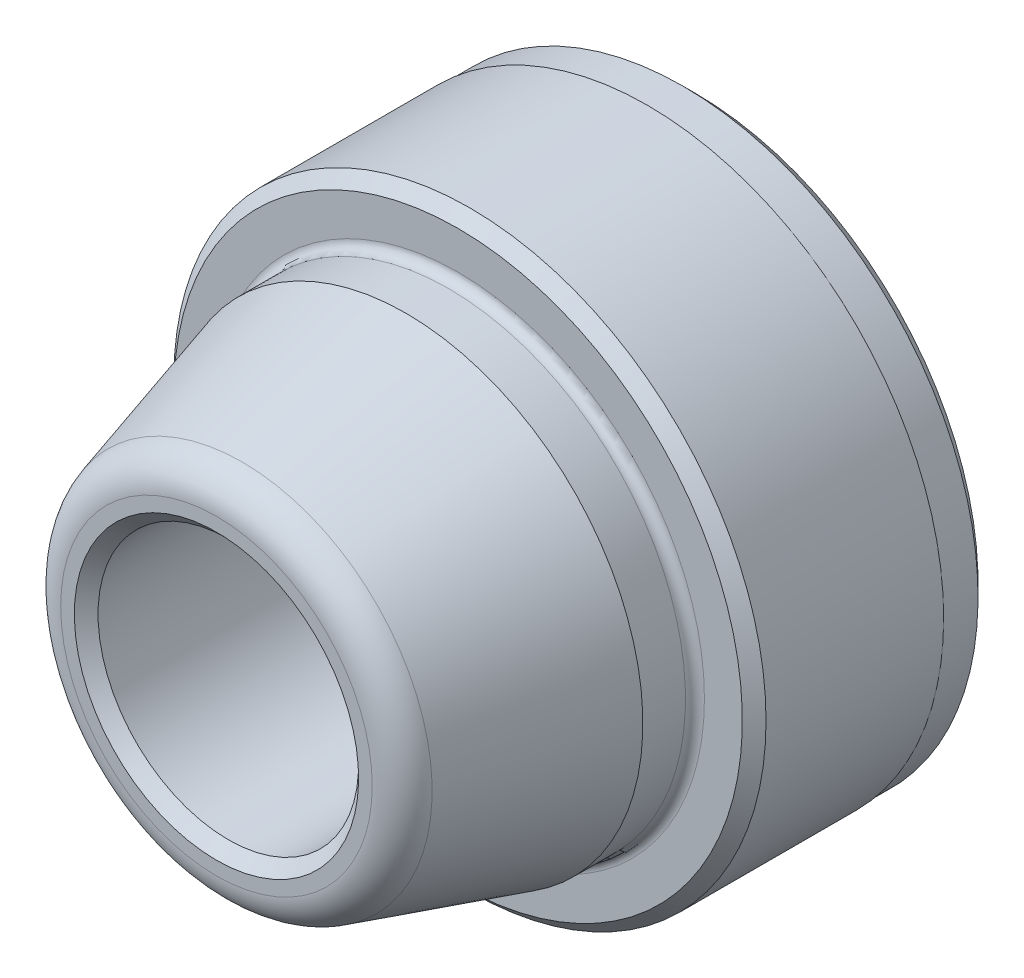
ISO-10303-21;
HEADER;
FILE_DESCRIPTION(('STEP AP214'),'2;1');
FILE_NAME('part.step','',(''),(''),'','','');
FILE_SCHEMA(('AUTOMOTIVE_DESIGN { 1 0 10303 214 1 1 1 1 }'));
ENDSEC;
DATA;
#1=APPLICATION_CONTEXT('core data for automotive mechanical design processes');
#2=APPLICATION_PROTOCOL_DEFINITION('international standard','automotive_design',2000,#1);
#3=PRODUCT_CONTEXT('',#1,'mechanical');
#4=PRODUCT('Part','Part','',(#3));
#5=PRODUCT_RELATED_PRODUCT_CATEGORY('part','',(#4));
#6=PRODUCT_DEFINITION_FORMATION('','',#4);
#7=PRODUCT_DEFINITION_CONTEXT('part definition',#1,'design');
#8=PRODUCT_DEFINITION('design','',#6,#7);
#9=PRODUCT_DEFINITION_SHAPE('','',#8);
#10=(LENGTH_UNIT() NAMED_UNIT(*) SI_UNIT(.MILLI.,.METRE.));
#11=(NAMED_UNIT(*) PLANE_ANGLE_UNIT() SI_UNIT($,.RADIAN.));
#12=(NAMED_UNIT(*) SI_UNIT($,.STERADIAN.) SOLID_ANGLE_UNIT());
#13=UNCERTAINTY_MEASURE_WITH_UNIT(LENGTH_MEASURE(1.E-05),#10,'distance_accuracy_value','');
#14=(GEOMETRIC_REPRESENTATION_CONTEXT(3) GLOBAL_UNCERTAINTY_ASSIGNED_CONTEXT((#13)) GLOBAL_UNIT_ASSIGNED_CONTEXT((#10,
#11,#12)) REPRESENTATION_CONTEXT('',''));
#15=CARTESIAN_POINT('',(0.,0.,0.));
#16=DIRECTION('',(0.,0.,1.));
#17=DIRECTION('',(1.,0.,0.));
#18=AXIS2_PLACEMENT_3D('',#15,#16,#17);
#19=CARTESIAN_POINT('',(0.,0.,0.));
#20=DIRECTION('',(0.,0.,-1.));
#21=DIRECTION('',(0.,1.,0.));
#22=AXIS2_PLACEMENT_3D('',#19,#20,#21);
#23=CYLINDRICAL_SURFACE('',#22,12.5);
#24=CARTESIAN_POINT('',(0.,0.,9.5));
#25=DIRECTION('',(0.,0.,1.));
#26=DIRECTION('',(0.,-1.,0.));
#27=AXIS2_PLACEMENT_3D('',#24,#25,#26);
#28=CIRCLE('',#27,12.5);
#29=CARTESIAN_POINT('',(0.,-12.5,9.5));
#30=VERTEX_POINT('',#29);
#31=EDGE_CURVE('E44',#30,#30,#28,.F.);
#32=ORIENTED_EDGE('',*,*,#31,.T.);
#33=EDGE_LOOP('',(#32));
#34=FACE_BOUND('',#33,.T.);
#35=CARTESIAN_POINT('',(0.,0.,2.));
#36=DIRECTION('',(0.,0.,-1.));
#37=DIRECTION('',(0.,1.,0.));
#38=AXIS2_PLACEMENT_3D('',#35,#36,#37);
#39=CIRCLE('',#38,12.5);
#40=CARTESIAN_POINT('',(0.,12.5,2.));
#41=VERTEX_POINT('',#40);
#42=EDGE_CURVE('E59',#41,#41,#39,.T.);
#43=ORIENTED_EDGE('',*,*,#42,.F.);
#44=EDGE_LOOP('',(#43));
#45=FACE_BOUND('',#44,.T.);
#46=ADVANCED_FACE('F12',(#34,#45),#23,.T.);
#47=CARTESIAN_POINT('',(0.,0.,0.));
#48=DIRECTION('',(0.,0.,-1.));
#49=DIRECTION('',(0.,1.,0.));
#50=AXIS2_PLACEMENT_3D('',#47,#48,#49);
#51=PLANE('',#50);
#52=CARTESIAN_POINT('',(0.,0.,0.));
#53=DIRECTION('',(0.,0.,-1.));
#54=DIRECTION('',(0.,1.,0.));
#55=AXIS2_PLACEMENT_3D('',#52,#53,#54);
#56=CIRCLE('',#55,6.5);
#57=CARTESIAN_POINT('',(0.,6.5,0.));
#58=VERTEX_POINT('',#57);
#59=EDGE_CURVE('E8',#58,#58,#56,.F.);
#60=ORIENTED_EDGE('',*,*,#59,.T.);
#61=EDGE_LOOP('',(#60));
#62=FACE_BOUND('',#61,.T.);
#63=CARTESIAN_POINT('',(0.,0.,0.));
#64=DIRECTION('',(0.,0.,-1.));
#65=DIRECTION('',(0.,1.,0.));
#66=AXIS2_PLACEMENT_3D('',#63,#64,#65);
#67=CIRCLE('',#66,11.95);
#68=CARTESIAN_POINT('',(0.,11.95,0.));
#69=VERTEX_POINT('',#68);
#70=EDGE_CURVE('E38',#69,#69,#67,.T.);
#71=ORIENTED_EDGE('',*,*,#70,.T.);
#72=EDGE_LOOP('',(#71));
#73=FACE_BOUND('',#72,.T.);
#74=ADVANCED_FACE('F93',(#62,#73),#51,.T.);
#75=CARTESIAN_POINT('',(0.,0.,20.2));
#76=DIRECTION('',(0.,0.,1.));
#77=DIRECTION('',(0.,-1.,0.));
#78=AXIS2_PLACEMENT_3D('',#75,#76,#77);
#79=PLANE('',#78);
#80=CARTESIAN_POINT('',(0.,0.,20.2));
#81=DIRECTION('',(0.,0.,1.));
#82=DIRECTION('',(0.,-1.,0.));
#83=AXIS2_PLACEMENT_3D('',#80,#81,#82);
#84=CIRCLE('',#83,6.57570583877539);
#85=CARTESIAN_POINT('',(0.,-6.57570583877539,20.2));
#86=VERTEX_POINT('',#85);
#87=EDGE_CURVE('E19',#86,#86,#84,.T.);
#88=ORIENTED_EDGE('',*,*,#87,.T.);
#89=EDGE_LOOP('',(#88));
#90=FACE_BOUND('',#89,.T.);
#91=CARTESIAN_POINT('',(0.,0.,20.2));
#92=DIRECTION('',(0.,0.,1.));
#93=DIRECTION('',(0.,-1.,0.));
#94=AXIS2_PLACEMENT_3D('',#91,#92,#93);
#95=CIRCLE('',#94,6.);
#96=CARTESIAN_POINT('',(0.,-6.,20.2));
#97=VERTEX_POINT('',#96);
#98=EDGE_CURVE('E47',#97,#97,#95,.F.);
#99=ORIENTED_EDGE('',*,*,#98,.T.);
#100=EDGE_LOOP('',(#99));
#101=FACE_BOUND('',#100,.T.);
#102=ADVANCED_FACE('F99',(#90,#101),#79,.T.);
#103=CARTESIAN_POINT('',(0.,0.,12.2));
#104=DIRECTION('',(0.,0.,-1.));
#105=DIRECTION('',(0.,1.,0.));
#106=AXIS2_PLACEMENT_3D('',#103,#104,#105);
#107=CONICAL_SURFACE('',#106,10.,0.279252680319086);
#108=CARTESIAN_POINT('',(0.,0.,19.1134560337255));
#109=DIRECTION('',(0.,0.,1.));
#110=DIRECTION('',(0.,-1.,0.));
#111=AXIS2_PLACEMENT_3D('',#108,#109,#110);
#112=CIRCLE('',#111,8.01759838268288);
#113=CARTESIAN_POINT('',(0.,-8.01759838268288,19.1134560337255));
#114=VERTEX_POINT('',#113);
#115=EDGE_CURVE('E23',#114,#114,#112,.F.);
#116=ORIENTED_EDGE('',*,*,#115,.T.);
#117=EDGE_LOOP('',(#116));
#118=FACE_BOUND('',#117,.T.);
#119=CARTESIAN_POINT('',(0.,0.,12.2));
#120=DIRECTION('',(0.,0.,-1.));
#121=DIRECTION('',(0.,1.,0.));
#122=AXIS2_PLACEMENT_3D('',#119,#120,#121);
#123=CIRCLE('',#122,10.);
#124=CARTESIAN_POINT('',(0.,10.,12.2));
#125=VERTEX_POINT('',#124);
#126=EDGE_CURVE('E53',#125,#125,#123,.T.);
#127=ORIENTED_EDGE('',*,*,#126,.F.);
#128=EDGE_LOOP('',(#127));
#129=FACE_BOUND('',#128,.T.);
#130=ADVANCED_FACE('F112',(#118,#129),#107,.T.);
#131=CARTESIAN_POINT('',(0.,0.,0.));
#132=DIRECTION('',(0.,0.,-1.));
#133=DIRECTION('',(0.,1.,0.));
#134=AXIS2_PLACEMENT_3D('',#131,#132,#133);
#135=CYLINDRICAL_SURFACE('',#134,10.);
#136=CARTESIAN_POINT('',(0.,0.,10.4));
#137=DIRECTION('',(0.,0.,1.));
#138=DIRECTION('',(0.,-1.,0.));
#139=AXIS2_PLACEMENT_3D('',#136,#137,#138);
#140=CIRCLE('',#139,10.);
#141=CARTESIAN_POINT('',(0.,-10.,10.4));
#142=VERTEX_POINT('',#141);
#143=EDGE_CURVE('E27',#142,#142,#140,.T.);
#144=ORIENTED_EDGE('',*,*,#143,.T.);
#145=EDGE_LOOP('',(#144));
#146=FACE_BOUND('',#145,.T.);
#147=ORIENTED_EDGE('',*,*,#126,.T.);
#148=EDGE_LOOP('',(#147));
#149=FACE_BOUND('',#148,.T.);
#150=ADVANCED_FACE('F108',(#146,#149),#135,.T.);
#151=CARTESIAN_POINT('',(10.,0.,10.));
#152=DIRECTION('',(0.,0.,1.));
#153=DIRECTION('',(0.,-1.,0.));
#154=AXIS2_PLACEMENT_3D('',#151,#152,#153);
#155=PLANE('',#154);
#156=CARTESIAN_POINT('',(0.,0.,10.));
#157=DIRECTION('',(0.,0.,1.));
#158=DIRECTION('',(0.,-1.,0.));
#159=AXIS2_PLACEMENT_3D('',#156,#157,#158);
#160=CIRCLE('',#159,10.4);
#161=CARTESIAN_POINT('',(0.,-10.4,10.));
#162=VERTEX_POINT('',#161);
#163=EDGE_CURVE('E32',#162,#162,#160,.F.);
#164=ORIENTED_EDGE('',*,*,#163,.T.);
#165=EDGE_LOOP('',(#164));
#166=FACE_BOUND('',#165,.T.);
#167=CARTESIAN_POINT('',(0.,0.,10.));
#168=DIRECTION('',(0.,0.,1.));
#169=DIRECTION('',(0.,-1.,0.));
#170=AXIS2_PLACEMENT_3D('',#167,#168,#169);
#171=CIRCLE('',#170,12.);
#172=CARTESIAN_POINT('',(0.,-12.,10.));
#173=VERTEX_POINT('',#172);
#174=EDGE_CURVE('E41',#173,#173,#171,.T.);
#175=ORIENTED_EDGE('',*,*,#174,.T.);
#176=EDGE_LOOP('',(#175));
#177=FACE_BOUND('',#176,.T.);
#178=ADVANCED_FACE('F104',(#166,#177),#155,.T.);
#179=CARTESIAN_POINT('',(0.,0.,0.));
#180=DIRECTION('',(0.,0.,-1.));
#181=DIRECTION('',(0.,1.,0.));
#182=AXIS2_PLACEMENT_3D('',#179,#180,#181);
#183=CYLINDRICAL_SURFACE('',#182,12.45);
#184=CARTESIAN_POINT('',(0.,0.,0.5));
#185=DIRECTION('',(0.,0.,-1.));
#186=DIRECTION('',(0.,1.,0.));
#187=AXIS2_PLACEMENT_3D('',#184,#185,#186);
#188=CIRCLE('',#187,12.45);
#189=CARTESIAN_POINT('',(0.,12.45,0.5));
#190=VERTEX_POINT('',#189);
#191=EDGE_CURVE('E35',#190,#190,#188,.F.);
#192=ORIENTED_EDGE('',*,*,#191,.T.);
#193=EDGE_LOOP('',(#192));
#194=FACE_BOUND('',#193,.T.);
#195=CARTESIAN_POINT('',(0.,0.,2.));
#196=DIRECTION('',(0.,0.,-1.));
#197=DIRECTION('',(0.,1.,0.));
#198=AXIS2_PLACEMENT_3D('',#195,#196,#197);
#199=CIRCLE('',#198,12.45);
#200=CARTESIAN_POINT('',(0.,12.45,2.));
#201=VERTEX_POINT('',#200);
#202=EDGE_CURVE('E56',#201,#201,#199,.T.);
#203=ORIENTED_EDGE('',*,*,#202,.T.);
#204=EDGE_LOOP('',(#203));
#205=FACE_BOUND('',#204,.T.);
#206=ADVANCED_FACE('F107',(#194,#205),#183,.T.);
#207=CARTESIAN_POINT('',(-12.45,0.,2.));
#208=DIRECTION('',(0.,0.,-1.));
#209=DIRECTION('',(0.,1.,0.));
#210=AXIS2_PLACEMENT_3D('',#207,#208,#209);
#211=PLANE('',#210);
#212=ORIENTED_EDGE('',*,*,#42,.T.);
#213=EDGE_LOOP('',(#212));
#214=FACE_BOUND('',#213,.T.);
#215=ORIENTED_EDGE('',*,*,#202,.F.);
#216=EDGE_LOOP('',(#215));
#217=FACE_BOUND('',#216,.T.);
#218=ADVANCED_FACE('F191',(#214,#217),#211,.T.);
#219=CARTESIAN_POINT('',(0.,0.,11.5));
#220=DIRECTION('',(0.,0.,1.));
#221=DIRECTION('',(0.,-1.,0.));
#222=AXIS2_PLACEMENT_3D('',#219,#220,#221);
#223=PLANE('',#222);
#224=CARTESIAN_POINT('',(0.,0.,11.5));
#225=DIRECTION('',(0.,0.,1.));
#226=DIRECTION('',(0.,-1.,0.));
#227=AXIS2_PLACEMENT_3D('',#224,#225,#226);
#228=CIRCLE('',#227,4.);
#229=CARTESIAN_POINT('',(0.,-4.,11.5));
#230=VERTEX_POINT('',#229);
#231=EDGE_CURVE('E68',#230,#230,#228,.T.);
#232=ORIENTED_EDGE('',*,*,#231,.F.);
#233=EDGE_LOOP('',(#232));
#234=FACE_BOUND('',#233,.T.);
#235=CARTESIAN_POINT('',(0.,0.,11.5));
#236=DIRECTION('',(0.,0.,1.));
#237=DIRECTION('',(0.,-1.,0.));
#238=AXIS2_PLACEMENT_3D('',#235,#236,#237);
#239=CIRCLE('',#238,5.5);
#240=CARTESIAN_POINT('',(0.,-5.5,11.5));
#241=VERTEX_POINT('',#240);
#242=EDGE_CURVE('E62',#241,#241,#239,.T.);
#243=ORIENTED_EDGE('',*,*,#242,.T.);
#244=EDGE_LOOP('',(#243));
#245=FACE_BOUND('',#244,.T.);
#246=ADVANCED_FACE('F186',(#234,#245),#223,.T.);
#247=CARTESIAN_POINT('',(0.,0.,11.5));
#248=DIRECTION('',(0.,0.,1.));
#249=DIRECTION('',(0.,-1.,0.));
#250=AXIS2_PLACEMENT_3D('',#247,#248,#249);
#251=CYLINDRICAL_SURFACE('',#250,5.5);
#252=CARTESIAN_POINT('',(0.,0.,19.7));
#253=DIRECTION('',(0.,0.,1.));
#254=DIRECTION('',(0.,-1.,0.));
#255=AXIS2_PLACEMENT_3D('',#252,#253,#254);
#256=CIRCLE('',#255,5.5);
#257=CARTESIAN_POINT('',(0.,-5.5,19.7));
#258=VERTEX_POINT('',#257);
#259=EDGE_CURVE('E50',#258,#258,#256,.T.);
#260=ORIENTED_EDGE('',*,*,#259,.T.);
#261=EDGE_LOOP('',(#260));
#262=FACE_BOUND('',#261,.T.);
#263=ORIENTED_EDGE('',*,*,#242,.F.);
#264=EDGE_LOOP('',(#263));
#265=FACE_BOUND('',#264,.T.);
#266=ADVANCED_FACE('F123',(#262,#265),#251,.F.);
#267=CARTESIAN_POINT('',(0.,0.,19.7));
#268=DIRECTION('',(0.,0.,1.));
#269=DIRECTION('',(0.,-1.,0.));
#270=AXIS2_PLACEMENT_3D('',#267,#268,#269);
#271=CONICAL_SURFACE('',#270,5.5,0.78539816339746);
#272=ORIENTED_EDGE('',*,*,#98,.F.);
#273=EDGE_LOOP('',(#272));
#274=FACE_BOUND('',#273,.T.);
#275=ORIENTED_EDGE('',*,*,#259,.F.);
#276=EDGE_LOOP('',(#275));
#277=FACE_BOUND('',#276,.T.);
#278=ADVANCED_FACE('F119',(#274,#277),#271,.F.);
#279=CARTESIAN_POINT('',(0.,0.,9.5));
#280=DIRECTION('',(0.,0.,-1.));
#281=DIRECTION('',(0.,1.,0.));
#282=AXIS2_PLACEMENT_3D('',#279,#280,#281);
#283=CONICAL_SURFACE('',#282,12.5,0.785398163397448);
#284=ORIENTED_EDGE('',*,*,#174,.F.);
#285=EDGE_LOOP('',(#284));
#286=FACE_BOUND('',#285,.T.);
#287=ORIENTED_EDGE('',*,*,#31,.F.);
#288=EDGE_LOOP('',(#287));
#289=FACE_BOUND('',#288,.T.);
#290=ADVANCED_FACE('F122',(#286,#289),#283,.T.);
#291=CARTESIAN_POINT('',(0.,0.,0.));
#292=DIRECTION('',(0.,0.,1.));
#293=DIRECTION('',(0.,-1.,0.));
#294=AXIS2_PLACEMENT_3D('',#291,#292,#293);
#295=CONICAL_SURFACE('',#294,11.95,0.785398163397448);
#296=ORIENTED_EDGE('',*,*,#191,.F.);
#297=EDGE_LOOP('',(#296));
#298=FACE_BOUND('',#297,.T.);
#299=ORIENTED_EDGE('',*,*,#70,.F.);
#300=EDGE_LOOP('',(#299));
#301=FACE_BOUND('',#300,.T.);
#302=ADVANCED_FACE('F127',(#298,#301),#295,.T.);
#303=CARTESIAN_POINT('',(0.,0.,10.4));
#304=DIRECTION('',(0.,0.,1.));
#305=DIRECTION('',(0.,-1.,0.));
#306=AXIS2_PLACEMENT_3D('',#303,#304,#305);
#307=TOROIDAL_SURFACE('',#306,10.4,0.4);
#308=ORIENTED_EDGE('',*,*,#143,.F.);
#309=EDGE_LOOP('',(#308));
#310=FACE_BOUND('',#309,.T.);
#311=ORIENTED_EDGE('',*,*,#163,.F.);
#312=EDGE_LOOP('',(#311));
#313=FACE_BOUND('',#312,.T.);
#314=ADVANCED_FACE('F88',(#310,#313),#307,.F.);
#315=CARTESIAN_POINT('',(0.,0.,18.7));
#316=DIRECTION('',(0.,0.,1.));
#317=DIRECTION('',(0.,-1.,0.));
#318=AXIS2_PLACEMENT_3D('',#315,#316,#317);
#319=TOROIDAL_SURFACE('',#318,6.57570583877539,1.5);
#320=ORIENTED_EDGE('',*,*,#87,.F.);
#321=EDGE_LOOP('',(#320));
#322=FACE_BOUND('',#321,.T.);
#323=ORIENTED_EDGE('',*,*,#115,.F.);
#324=EDGE_LOOP('',(#323));
#325=FACE_BOUND('',#324,.T.);
#326=ADVANCED_FACE('F79',(#322,#325),#319,.T.);
#327=CARTESIAN_POINT('',(0.,0.,0.5));
#328=DIRECTION('',(0.,0.,-1.));
#329=DIRECTION('',(0.,1.,0.));
#330=AXIS2_PLACEMENT_3D('',#327,#328,#329);
#331=PLANE('',#330);
#332=CARTESIAN_POINT('',(0.,0.,0.5));
#333=DIRECTION('',(0.,0.,-1.));
#334=DIRECTION('',(0.,1.,0.));
#335=AXIS2_PLACEMENT_3D('',#332,#333,#334);
#336=CIRCLE('',#335,6.);
#337=CARTESIAN_POINT('',(0.,6.,0.5));
#338=VERTEX_POINT('',#337);
#339=EDGE_CURVE('E65',#338,#338,#336,.T.);
#340=ORIENTED_EDGE('',*,*,#339,.T.);
#341=EDGE_LOOP('',(#340));
#342=FACE_BOUND('',#341,.T.);
#343=CARTESIAN_POINT('',(0.,0.,0.5));
#344=DIRECTION('',(0.,0.,-1.));
#345=DIRECTION('',(0.,1.,0.));
#346=AXIS2_PLACEMENT_3D('',#343,#344,#345);
#347=CIRCLE('',#346,4.);
#348=CARTESIAN_POINT('',(0.,4.,0.5));
#349=VERTEX_POINT('',#348);
#350=EDGE_CURVE('E71',#349,#349,#347,.T.);
#351=ORIENTED_EDGE('',*,*,#350,.F.);
#352=EDGE_LOOP('',(#351));
#353=FACE_BOUND('',#352,.T.);
#354=ADVANCED_FACE('F77',(#342,#353),#331,.T.);
#355=CARTESIAN_POINT('',(0.,0.,0.5));
#356=DIRECTION('',(0.,0.,-1.));
#357=DIRECTION('',(0.,1.,0.));
#358=AXIS2_PLACEMENT_3D('',#355,#356,#357);
#359=CONICAL_SURFACE('',#358,6.,0.785398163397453);
#360=ORIENTED_EDGE('',*,*,#59,.F.);
#361=EDGE_LOOP('',(#360));
#362=FACE_BOUND('',#361,.T.);
#363=ORIENTED_EDGE('',*,*,#339,.F.);
#364=EDGE_LOOP('',(#363));
#365=FACE_BOUND('',#364,.T.);
#366=ADVANCED_FACE('F14',(#362,#365),#359,.F.);
#367=CARTESIAN_POINT('',(0.,0.,20.2));
#368=DIRECTION('',(0.,0.,-1.));
#369=DIRECTION('',(0.,1.,0.));
#370=AXIS2_PLACEMENT_3D('',#367,#368,#369);
#371=CYLINDRICAL_SURFACE('',#370,4.);
#372=ORIENTED_EDGE('',*,*,#231,.T.);
#373=EDGE_LOOP('',(#372));
#374=FACE_BOUND('',#373,.T.);
#375=ORIENTED_EDGE('',*,*,#350,.T.);
#376=EDGE_LOOP('',(#375));
#377=FACE_BOUND('',#376,.T.);
#378=ADVANCED_FACE('F75',(#374,#377),#371,.F.);
#379=CLOSED_SHELL('',(#46,#74,#102,#130,#150,#178,#206,#218,#246,#266,#278,#290,#302,#314,#326,
#354,#366,#378));
#380=MANIFOLD_SOLID_BREP('B1',#379);
#381=ADVANCED_BREP_SHAPE_REPRESENTATION('',(#18,#380),#14);
#382=SHAPE_DEFINITION_REPRESENTATION(#9,#381);
ENDSEC;
END-ISO-10303-21;
